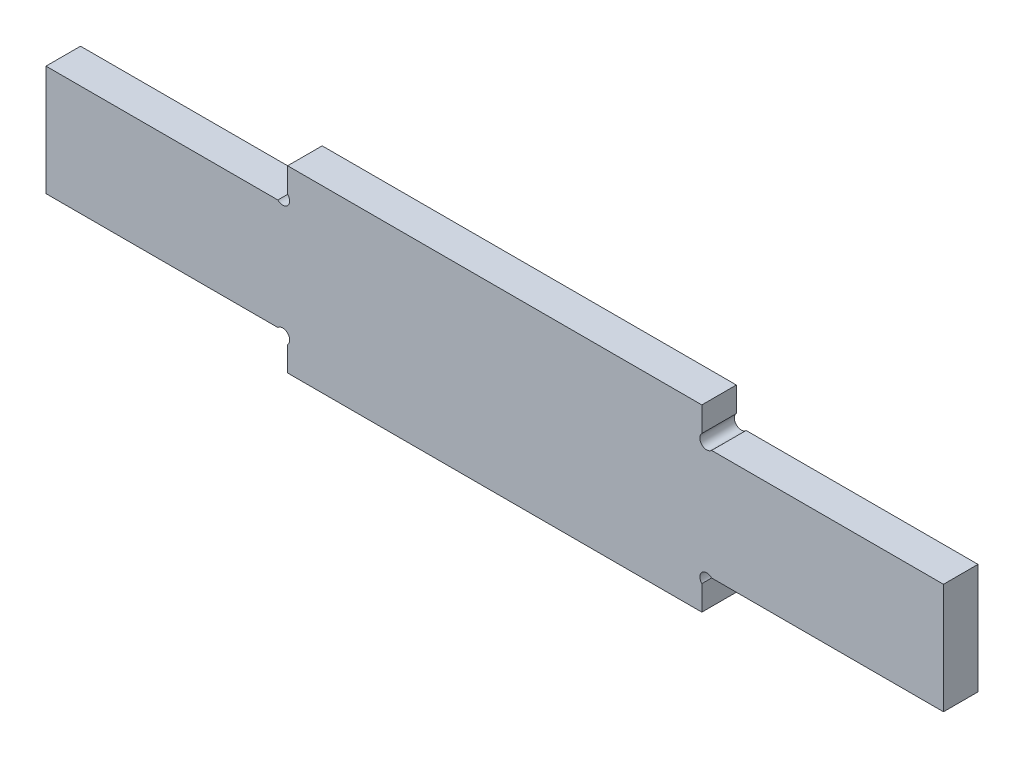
from build123d import *

# Parameters (mm, degrees)
ESQUISSE1_W             = 65
ESQUISSE1_H             = 26
BOSS_EXTRU_1_DEPTH      = 5
ENL_V_MAT_EXTRU_1_REACH = 72.185
ESQUISSE2_W             = 35
ESQUISSE2_H             = 5
ENL_V_START             = -5
ESQUISSE3_R             = 1
ENL_V_MAT_EXTRU_2_DEPTH = 5


with BuildPart() as part:
    # Esquisse1 → Boss.-Extru.1 (new body)
    with BuildSketch(Plane.XY):
        with Locations((32.5, 13)):
            Rectangle(ESQUISSE1_W, ESQUISSE1_H)
    boss_extru_1 = extrude(amount=BOSS_EXTRU_1_DEPTH)

    # Esquisse2 → Enl_v. mat.-Extru.1 (cut, up to next)
    with BuildSketch(Plane.XY.offset(5), mode=Mode.PRIVATE) as enl_v_mat_extru_1_sk1:
        with Locations((17.5, 23.5)):
            Rectangle(ESQUISSE2_W, ESQUISSE2_H)
    enl_v_mat_extru_1_tool1 = extrude(enl_v_mat_extru_1_sk1.sketch, amount=-ENL_V_MAT_EXTRU_1_REACH, mode=Mode.PRIVATE) & part.part
    # Esquisse2 → Enl_v. mat.-Extru.1 (cut, up to next)
    with BuildSketch(Plane.XY.offset(5), mode=Mode.PRIVATE) as enl_v_mat_extru_1_sk2:
        with Locations((17.5, 2.5)):
            Rectangle(ESQUISSE2_W, ESQUISSE2_H)
    enl_v_mat_extru_1_tool2 = extrude(enl_v_mat_extru_1_sk2.sketch, amount=-ENL_V_MAT_EXTRU_1_REACH, mode=Mode.PRIVATE) & part.part
    enl_v_mat_extru_1_1 = enl_v_mat_extru_1_tool1.solids().sort_by_distance((17.5, 23.5, 5))[0]
    add(enl_v_mat_extru_1_1, mode=Mode.SUBTRACT)
    enl_v_mat_extru_1_2 = enl_v_mat_extru_1_tool2.solids().sort_by_distance((17.5, 2.5, 5))[0]
    add(enl_v_mat_extru_1_2, mode=Mode.SUBTRACT)
    enl_v_mat_extru_1 = enl_v_mat_extru_1_1 + enl_v_mat_extru_1_2  # Enl_v. mat.-Extru.1 as one shape, for the pattern or mirror that repeats it

    # Esquisse3 → Enl_v. mat.-Extru.2 (cut)
    with BuildSketch(Plane.XY.offset(5).offset(ENL_V_START)):
        with Locations((34.292893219, 21.707106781)):
            Circle(ESQUISSE3_R)
        with Locations((34.292893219, 4.292893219)):
            Circle(ESQUISSE3_R)
    enl_v_mat_extru_2 = extrude(amount=ENL_V_MAT_EXTRU_2_DEPTH, mode=Mode.SUBTRACT)

    # Sym_trie1: Boss.-Extru.1, Enl_v. mat.-Extru.1, Enl_v. mat.-Extru.2 across plane
    add(boss_extru_1.mirror(Plane(origin=(65, 0, 5), x_dir=(0, 0, 1), z_dir=(-1, 0, 0))))
    add(enl_v_mat_extru_1.mirror(Plane(origin=(65, 0, 5), x_dir=(0, 0, 1), z_dir=(-1, 0, 0))), mode=Mode.SUBTRACT)
    add(enl_v_mat_extru_2.mirror(Plane(origin=(65, 0, 5), x_dir=(0, 0, 1), z_dir=(-1, 0, 0))), mode=Mode.SUBTRACT)


solid = part.part
